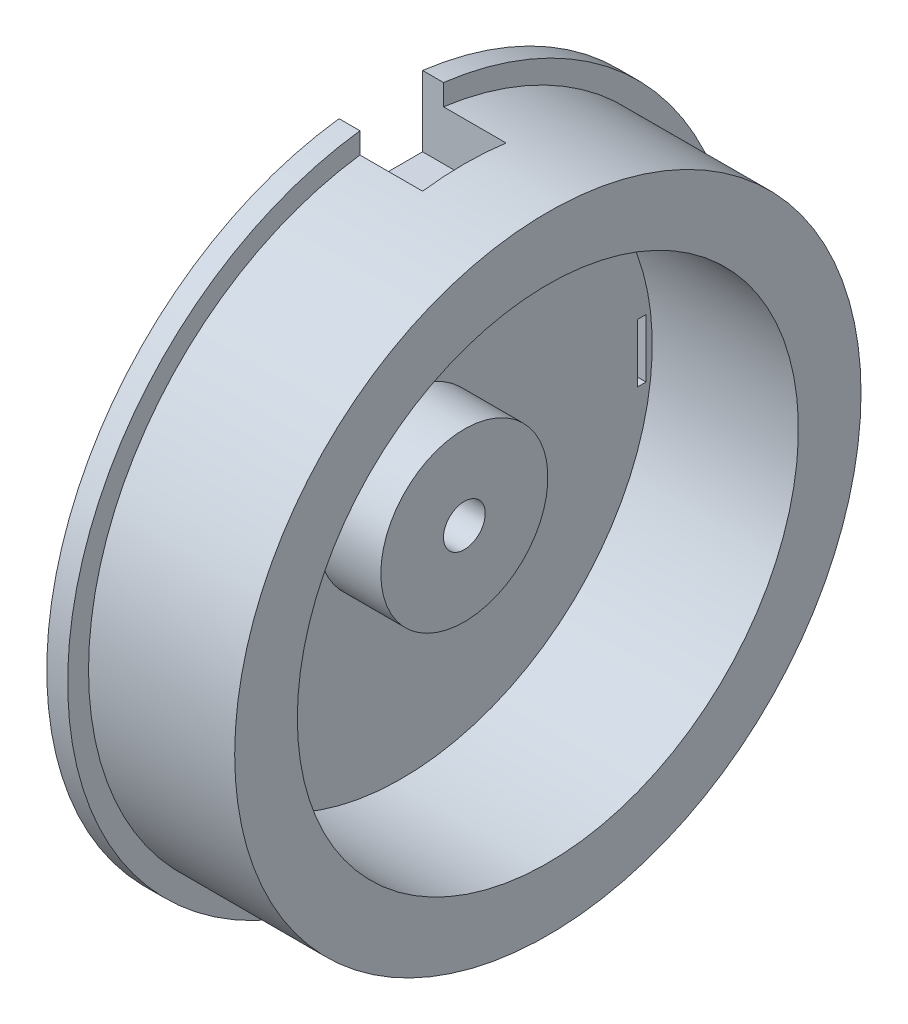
ISO-10303-21;
HEADER;
FILE_DESCRIPTION(('STEP AP214'),'2;1');
FILE_NAME('part.step','',(''),(''),'','','');
FILE_SCHEMA(('AUTOMOTIVE_DESIGN { 1 0 10303 214 1 1 1 1 }'));
ENDSEC;
DATA;
#1=APPLICATION_CONTEXT('core data for automotive mechanical design processes');
#2=APPLICATION_PROTOCOL_DEFINITION('international standard','automotive_design',2000,#1);
#3=PRODUCT_CONTEXT('',#1,'mechanical');
#4=PRODUCT('Part','Part','',(#3));
#5=PRODUCT_RELATED_PRODUCT_CATEGORY('part','',(#4));
#6=PRODUCT_DEFINITION_FORMATION('','',#4);
#7=PRODUCT_DEFINITION_CONTEXT('part definition',#1,'design');
#8=PRODUCT_DEFINITION('design','',#6,#7);
#9=PRODUCT_DEFINITION_SHAPE('','',#8);
#10=(LENGTH_UNIT() NAMED_UNIT(*) SI_UNIT(.MILLI.,.METRE.));
#11=(NAMED_UNIT(*) PLANE_ANGLE_UNIT() SI_UNIT($,.RADIAN.));
#12=(NAMED_UNIT(*) SI_UNIT($,.STERADIAN.) SOLID_ANGLE_UNIT());
#13=UNCERTAINTY_MEASURE_WITH_UNIT(LENGTH_MEASURE(1.E-05),#10,'distance_accuracy_value','');
#14=(GEOMETRIC_REPRESENTATION_CONTEXT(3) GLOBAL_UNCERTAINTY_ASSIGNED_CONTEXT((#13)) GLOBAL_UNIT_ASSIGNED_CONTEXT((#10,
#11,#12)) REPRESENTATION_CONTEXT('',''));
#15=CARTESIAN_POINT('',(0.,0.,0.));
#16=DIRECTION('',(0.,0.,1.));
#17=DIRECTION('',(1.,0.,0.));
#18=AXIS2_PLACEMENT_3D('',#15,#16,#17);
#19=CARTESIAN_POINT('',(0.,0.,0.));
#20=DIRECTION('',(-1.,0.,0.));
#21=DIRECTION('',(0.,0.,1.));
#22=AXIS2_PLACEMENT_3D('',#19,#20,#21);
#23=CYLINDRICAL_SURFACE('',#22,15.9999999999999);
#24=CARTESIAN_POINT('',(0.,0.,0.));
#25=DIRECTION('',(-1.,0.,0.));
#26=DIRECTION('',(0.,0.,1.));
#27=AXIS2_PLACEMENT_3D('',#24,#25,#26);
#28=CIRCLE('',#27,15.9999999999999);
#29=CARTESIAN_POINT('',(0.,-15.8745078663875,1.99999999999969));
#30=VERTEX_POINT('',#29);
#31=CARTESIAN_POINT('',(0.,15.8745078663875,1.99999999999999));
#32=VERTEX_POINT('',#31);
#33=EDGE_CURVE('E307',#30,#32,#28,.T.);
#34=ORIENTED_EDGE('',*,*,#33,.F.);
#35=DIRECTION('',(-1.,0.,0.));
#36=VECTOR('',#35,1.);
#37=CARTESIAN_POINT('',(4.,-15.8745078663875,1.99999999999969));
#38=LINE('',#37,#36);
#39=CARTESIAN_POINT('',(0.999999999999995,-15.8745078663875,1.99999999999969));
#40=VERTEX_POINT('',#39);
#41=EDGE_CURVE('E251',#40,#30,#38,.T.);
#42=ORIENTED_EDGE('',*,*,#41,.F.);
#43=CARTESIAN_POINT('',(0.999999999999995,0.,0.));
#44=DIRECTION('',(-1.,0.,0.));
#45=DIRECTION('',(0.,0.,1.));
#46=AXIS2_PLACEMENT_3D('',#43,#44,#45);
#47=CIRCLE('',#46,15.9999999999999);
#48=CARTESIAN_POINT('',(0.999999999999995,15.8745078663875,1.99999999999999));
#49=VERTEX_POINT('',#48);
#50=EDGE_CURVE('E342',#40,#49,#47,.T.);
#51=ORIENTED_EDGE('',*,*,#50,.T.);
#52=DIRECTION('',(-1.,0.,0.));
#53=VECTOR('',#52,1.);
#54=CARTESIAN_POINT('',(4.,15.8745078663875,1.99999999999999));
#55=LINE('',#54,#53);
#56=EDGE_CURVE('E291',#49,#32,#55,.T.);
#57=ORIENTED_EDGE('',*,*,#56,.T.);
#58=EDGE_LOOP('',(#34,#42,#51,#57));
#59=FACE_BOUND('',#58,.T.);
#60=ADVANCED_FACE('F27',(#59),#23,.T.);
#61=CARTESIAN_POINT('',(0.999999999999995,15.9999999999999,0.));
#62=DIRECTION('',(-1.,0.,0.));
#63=DIRECTION('',(0.,0.,1.));
#64=AXIS2_PLACEMENT_3D('',#61,#62,#63);
#65=PLANE('',#64);
#66=ORIENTED_EDGE('',*,*,#50,.F.);
#67=DIRECTION('',(0.,1.,0.));
#68=VECTOR('',#67,1.);
#69=CARTESIAN_POINT('',(0.999999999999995,15.9999999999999,2.00000000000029));
#70=LINE('',#69,#68);
#71=CARTESIAN_POINT('',(0.999999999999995,-14.8660687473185,1.99999999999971));
#72=VERTEX_POINT('',#71);
#73=EDGE_CURVE('E266',#40,#72,#70,.T.);
#74=ORIENTED_EDGE('',*,*,#73,.T.);
#75=CARTESIAN_POINT('',(0.999999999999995,0.,0.));
#76=DIRECTION('',(-1.,0.,0.));
#77=DIRECTION('',(0.,0.,1.));
#78=AXIS2_PLACEMENT_3D('',#75,#76,#77);
#79=CIRCLE('',#78,14.9999999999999);
#80=CARTESIAN_POINT('',(0.999999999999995,14.8660687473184,1.99999999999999));
#81=VERTEX_POINT('',#80);
#82=EDGE_CURVE('E338',#72,#81,#79,.T.);
#83=ORIENTED_EDGE('',*,*,#82,.T.);
#84=DIRECTION('',(0.,1.,0.));
#85=VECTOR('',#84,1.);
#86=CARTESIAN_POINT('',(0.999999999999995,15.9999999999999,1.99999999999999));
#87=LINE('',#86,#85);
#88=EDGE_CURVE('E298',#81,#49,#87,.T.);
#89=ORIENTED_EDGE('',*,*,#88,.T.);
#90=EDGE_LOOP('',(#66,#74,#83,#89));
#91=FACE_BOUND('',#90,.T.);
#92=ADVANCED_FACE('F380',(#91),#65,.F.);
#93=CARTESIAN_POINT('',(0.999999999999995,15.8745078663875,-1.99999999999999));
#94=VERTEX_POINT('',#93);
#95=CARTESIAN_POINT('',(0.999999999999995,-15.8745078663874,-2.00000000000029));
#96=VERTEX_POINT('',#95);
#97=EDGE_CURVE('E343',#94,#96,#47,.T.);
#98=ORIENTED_EDGE('',*,*,#97,.T.);
#99=DIRECTION('',(-1.,0.,0.));
#100=VECTOR('',#99,1.);
#101=CARTESIAN_POINT('',(4.,-15.8745078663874,-2.00000000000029));
#102=LINE('',#101,#100);
#103=CARTESIAN_POINT('',(0.,-15.8745078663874,-2.00000000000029));
#104=VERTEX_POINT('',#103);
#105=EDGE_CURVE('E253',#96,#104,#102,.T.);
#106=ORIENTED_EDGE('',*,*,#105,.T.);
#107=CARTESIAN_POINT('',(0.,15.8745078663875,-1.99999999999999));
#108=VERTEX_POINT('',#107);
#109=EDGE_CURVE('E308',#108,#104,#28,.T.);
#110=ORIENTED_EDGE('',*,*,#109,.F.);
#111=DIRECTION('',(-1.,0.,0.));
#112=VECTOR('',#111,1.);
#113=CARTESIAN_POINT('',(4.,15.8745078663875,-1.99999999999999));
#114=LINE('',#113,#112);
#115=EDGE_CURVE('E289',#94,#108,#114,.T.);
#116=ORIENTED_EDGE('',*,*,#115,.F.);
#117=EDGE_LOOP('',(#98,#106,#110,#116));
#118=FACE_BOUND('',#117,.T.);
#119=ADVANCED_FACE('F29',(#118),#23,.T.);
#120=CARTESIAN_POINT('',(0.999999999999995,14.8660687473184,-1.99999999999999));
#121=VERTEX_POINT('',#120);
#122=CARTESIAN_POINT('',(0.999999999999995,-14.8660687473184,-2.00000000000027));
#123=VERTEX_POINT('',#122);
#124=EDGE_CURVE('E339',#121,#123,#79,.T.);
#125=ORIENTED_EDGE('',*,*,#124,.T.);
#126=DIRECTION('',(0.,-1.,0.));
#127=VECTOR('',#126,1.);
#128=CARTESIAN_POINT('',(0.999999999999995,16.,-1.99999999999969));
#129=LINE('',#128,#127);
#130=EDGE_CURVE('E260',#123,#96,#129,.T.);
#131=ORIENTED_EDGE('',*,*,#130,.T.);
#132=ORIENTED_EDGE('',*,*,#97,.F.);
#133=DIRECTION('',(0.,-1.,0.));
#134=VECTOR('',#133,1.);
#135=CARTESIAN_POINT('',(0.999999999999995,15.9999999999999,-1.99999999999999));
#136=LINE('',#135,#134);
#137=EDGE_CURVE('E304',#94,#121,#136,.T.);
#138=ORIENTED_EDGE('',*,*,#137,.T.);
#139=EDGE_LOOP('',(#125,#131,#132,#138));
#140=FACE_BOUND('',#139,.T.);
#141=ADVANCED_FACE('F361',(#140),#65,.F.);
#142=CARTESIAN_POINT('',(0.,0.,0.));
#143=DIRECTION('',(-1.,0.,0.));
#144=DIRECTION('',(0.,0.,1.));
#145=AXIS2_PLACEMENT_3D('',#142,#143,#144);
#146=CYLINDRICAL_SURFACE('',#145,14.9999999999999);
#147=ORIENTED_EDGE('',*,*,#82,.F.);
#148=DIRECTION('',(-1.,0.,0.));
#149=VECTOR('',#148,1.);
#150=CARTESIAN_POINT('',(0.,-14.8660687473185,1.99999999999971));
#151=LINE('',#150,#149);
#152=CARTESIAN_POINT('',(4.,-14.8660687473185,1.99999999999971));
#153=VERTEX_POINT('',#152);
#154=EDGE_CURVE('E263',#72,#153,#151,.F.);
#155=ORIENTED_EDGE('',*,*,#154,.T.);
#156=CARTESIAN_POINT('',(4.,0.,0.));
#157=DIRECTION('',(-1.,0.,0.));
#158=DIRECTION('',(0.,0.,1.));
#159=AXIS2_PLACEMENT_3D('',#156,#157,#158);
#160=CIRCLE('',#159,14.9999999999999);
#161=CARTESIAN_POINT('',(4.,-14.8660687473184,-2.00000000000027));
#162=VERTEX_POINT('',#161);
#163=EDGE_CURVE('E11',#162,#153,#160,.T.);
#164=ORIENTED_EDGE('',*,*,#163,.F.);
#165=DIRECTION('',(-1.,0.,0.));
#166=VECTOR('',#165,1.);
#167=CARTESIAN_POINT('',(0.,-14.8660687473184,-2.00000000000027));
#168=LINE('',#167,#166);
#169=EDGE_CURVE('E250',#162,#123,#168,.T.);
#170=ORIENTED_EDGE('',*,*,#169,.T.);
#171=ORIENTED_EDGE('',*,*,#124,.F.);
#172=DIRECTION('',(-1.,0.,0.));
#173=VECTOR('',#172,1.);
#174=CARTESIAN_POINT('',(0.,14.8660687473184,-1.99999999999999));
#175=LINE('',#174,#173);
#176=CARTESIAN_POINT('',(4.,14.8660687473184,-1.99999999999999));
#177=VERTEX_POINT('',#176);
#178=EDGE_CURVE('E301',#121,#177,#175,.F.);
#179=ORIENTED_EDGE('',*,*,#178,.T.);
#180=CARTESIAN_POINT('',(4.,0.,0.));
#181=DIRECTION('',(-1.,0.,0.));
#182=DIRECTION('',(0.,0.,1.));
#183=AXIS2_PLACEMENT_3D('',#180,#181,#182);
#184=CIRCLE('',#183,14.9999999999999);
#185=CARTESIAN_POINT('',(4.,14.8660687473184,1.99999999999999));
#186=VERTEX_POINT('',#185);
#187=EDGE_CURVE('E35',#186,#177,#184,.T.);
#188=ORIENTED_EDGE('',*,*,#187,.F.);
#189=DIRECTION('',(-1.,0.,0.));
#190=VECTOR('',#189,1.);
#191=CARTESIAN_POINT('',(0.,14.8660687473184,1.99999999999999));
#192=LINE('',#191,#190);
#193=EDGE_CURVE('E288',#186,#81,#192,.T.);
#194=ORIENTED_EDGE('',*,*,#193,.T.);
#195=EDGE_LOOP('',(#147,#155,#164,#170,#171,#179,#188,#194));
#196=FACE_BOUND('',#195,.T.);
#197=CARTESIAN_POINT('',(7.99999999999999,0.,0.));
#198=DIRECTION('',(-1.,0.,0.));
#199=DIRECTION('',(0.,0.,1.));
#200=AXIS2_PLACEMENT_3D('',#197,#198,#199);
#201=CIRCLE('',#200,14.9999999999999);
#202=CARTESIAN_POINT('',(7.99999999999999,0.,14.9999999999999));
#203=VERTEX_POINT('',#202);
#204=EDGE_CURVE('E335',#203,#203,#201,.T.);
#205=ORIENTED_EDGE('',*,*,#204,.T.);
#206=EDGE_LOOP('',(#205));
#207=FACE_BOUND('',#206,.T.);
#208=ADVANCED_FACE('F357',(#196,#207),#146,.T.);
#209=CARTESIAN_POINT('',(7.99999999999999,14.9999999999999,0.));
#210=DIRECTION('',(-1.,0.,0.));
#211=DIRECTION('',(0.,0.,1.));
#212=AXIS2_PLACEMENT_3D('',#209,#210,#211);
#213=PLANE('',#212);
#214=ORIENTED_EDGE('',*,*,#204,.F.);
#215=EDGE_LOOP('',(#214));
#216=FACE_BOUND('',#215,.T.);
#217=CARTESIAN_POINT('',(7.99999999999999,0.,0.));
#218=DIRECTION('',(-1.,0.,0.));
#219=DIRECTION('',(0.,0.,1.));
#220=AXIS2_PLACEMENT_3D('',#217,#218,#219);
#221=CIRCLE('',#220,11.9999999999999);
#222=CARTESIAN_POINT('',(7.99999999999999,0.,11.9999999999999));
#223=VERTEX_POINT('',#222);
#224=EDGE_CURVE('E332',#223,#223,#221,.T.);
#225=ORIENTED_EDGE('',*,*,#224,.T.);
#226=EDGE_LOOP('',(#225));
#227=FACE_BOUND('',#226,.T.);
#228=ADVANCED_FACE('F417',(#216,#227),#213,.F.);
#229=CARTESIAN_POINT('',(0.,0.,0.));
#230=DIRECTION('',(-1.,0.,0.));
#231=DIRECTION('',(0.,0.,1.));
#232=AXIS2_PLACEMENT_3D('',#229,#230,#231);
#233=CYLINDRICAL_SURFACE('',#232,11.9999999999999);
#234=ORIENTED_EDGE('',*,*,#224,.F.);
#235=EDGE_LOOP('',(#234));
#236=FACE_BOUND('',#235,.T.);
#237=CARTESIAN_POINT('',(0.999999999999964,0.,0.));
#238=DIRECTION('',(-1.,0.,0.));
#239=DIRECTION('',(0.,0.,1.));
#240=AXIS2_PLACEMENT_3D('',#237,#238,#239);
#241=CIRCLE('',#240,11.9999999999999);
#242=CARTESIAN_POINT('',(0.999999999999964,0.,11.9999999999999));
#243=VERTEX_POINT('',#242);
#244=EDGE_CURVE('E329',#243,#243,#241,.T.);
#245=ORIENTED_EDGE('',*,*,#244,.T.);
#246=EDGE_LOOP('',(#245));
#247=FACE_BOUND('',#246,.T.);
#248=ADVANCED_FACE('F422',(#236,#247),#233,.F.);
#249=CARTESIAN_POINT('',(0.999999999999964,11.9999999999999,0.));
#250=DIRECTION('',(-1.,0.,0.));
#251=DIRECTION('',(0.,0.,1.));
#252=AXIS2_PLACEMENT_3D('',#249,#250,#251);
#253=PLANE('',#252);
#254=DIRECTION('',(0.,0.,1.));
#255=VECTOR('',#254,1.);
#256=CARTESIAN_POINT('',(0.999999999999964,-1.4,-2.54243230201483E-13));
#257=LINE('',#256,#255);
#258=CARTESIAN_POINT('',(0.999999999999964,-1.39999999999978,-11.7));
#259=VERTEX_POINT('',#258);
#260=CARTESIAN_POINT('',(0.999999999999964,-1.39999999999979,-11.3));
#261=VERTEX_POINT('',#260);
#262=EDGE_CURVE('E194',#259,#261,#257,.T.);
#263=ORIENTED_EDGE('',*,*,#262,.T.);
#264=DIRECTION('',(0.,1.,0.));
#265=VECTOR('',#264,1.);
#266=CARTESIAN_POINT('',(0.999999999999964,12.0000000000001,-11.2999999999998));
#267=LINE('',#266,#265);
#268=CARTESIAN_POINT('',(0.999999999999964,1.40000000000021,-11.3));
#269=VERTEX_POINT('',#268);
#270=EDGE_CURVE('E197',#261,#269,#267,.T.);
#271=ORIENTED_EDGE('',*,*,#270,.T.);
#272=DIRECTION('',(0.,0.,-1.));
#273=VECTOR('',#272,1.);
#274=CARTESIAN_POINT('',(0.999999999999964,1.4,-2.06864050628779E-13));
#275=LINE('',#274,#273);
#276=CARTESIAN_POINT('',(0.999999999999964,1.40000000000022,-11.7));
#277=VERTEX_POINT('',#276);
#278=EDGE_CURVE('E189',#269,#277,#275,.T.);
#279=ORIENTED_EDGE('',*,*,#278,.T.);
#280=DIRECTION('',(0.,-1.,0.));
#281=VECTOR('',#280,1.);
#282=CARTESIAN_POINT('',(0.999999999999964,12.0000000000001,-11.6999999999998));
#283=LINE('',#282,#281);
#284=EDGE_CURVE('E169',#277,#259,#283,.T.);
#285=ORIENTED_EDGE('',*,*,#284,.T.);
#286=EDGE_LOOP('',(#263,#271,#279,#285));
#287=FACE_BOUND('',#286,.T.);
#288=DIRECTION('',(0.,0.,-1.));
#289=VECTOR('',#288,1.);
#290=CARTESIAN_POINT('',(0.999999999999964,1.4,0.));
#291=LINE('',#290,#289);
#292=CARTESIAN_POINT('',(0.999999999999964,1.4,11.7));
#293=VERTEX_POINT('',#292);
#294=CARTESIAN_POINT('',(0.999999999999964,1.4,11.3));
#295=VERTEX_POINT('',#294);
#296=EDGE_CURVE('E226',#293,#295,#291,.T.);
#297=ORIENTED_EDGE('',*,*,#296,.T.);
#298=DIRECTION('',(0.,-1.,0.));
#299=VECTOR('',#298,1.);
#300=CARTESIAN_POINT('',(0.999999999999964,11.9999999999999,11.3));
#301=LINE('',#300,#299);
#302=CARTESIAN_POINT('',(0.999999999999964,-1.4,11.3));
#303=VERTEX_POINT('',#302);
#304=EDGE_CURVE('E229',#295,#303,#301,.T.);
#305=ORIENTED_EDGE('',*,*,#304,.T.);
#306=DIRECTION('',(0.,0.,1.));
#307=VECTOR('',#306,1.);
#308=CARTESIAN_POINT('',(0.999999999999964,-1.39999999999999,0.));
#309=LINE('',#308,#307);
#310=CARTESIAN_POINT('',(0.999999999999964,-1.4,11.7));
#311=VERTEX_POINT('',#310);
#312=EDGE_CURVE('E214',#303,#311,#309,.T.);
#313=ORIENTED_EDGE('',*,*,#312,.T.);
#314=DIRECTION('',(0.,1.,0.));
#315=VECTOR('',#314,1.);
#316=CARTESIAN_POINT('',(0.999999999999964,11.9999999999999,11.7));
#317=LINE('',#316,#315);
#318=EDGE_CURVE('E223',#311,#293,#317,.T.);
#319=ORIENTED_EDGE('',*,*,#318,.T.);
#320=EDGE_LOOP('',(#297,#305,#313,#319));
#321=FACE_BOUND('',#320,.T.);
#322=ORIENTED_EDGE('',*,*,#244,.F.);
#323=EDGE_LOOP('',(#322));
#324=FACE_BOUND('',#323,.T.);
#325=CARTESIAN_POINT('',(0.999999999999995,0.,0.));
#326=DIRECTION('',(-1.,0.,0.));
#327=DIRECTION('',(0.,0.,1.));
#328=AXIS2_PLACEMENT_3D('',#325,#326,#327);
#329=CIRCLE('',#328,3.99999999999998);
#330=CARTESIAN_POINT('',(0.999999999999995,0.,3.99999999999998));
#331=VERTEX_POINT('',#330);
#332=EDGE_CURVE('E326',#331,#331,#329,.T.);
#333=ORIENTED_EDGE('',*,*,#332,.T.);
#334=EDGE_LOOP('',(#333));
#335=FACE_BOUND('',#334,.T.);
#336=ADVANCED_FACE('F426',(#287,#321,#324,#335),#253,.F.);
#337=CARTESIAN_POINT('',(0.,0.,0.));
#338=DIRECTION('',(-1.,0.,0.));
#339=DIRECTION('',(0.,0.,1.));
#340=AXIS2_PLACEMENT_3D('',#337,#338,#339);
#341=CYLINDRICAL_SURFACE('',#340,3.99999999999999);
#342=ORIENTED_EDGE('',*,*,#332,.F.);
#343=EDGE_LOOP('',(#342));
#344=FACE_BOUND('',#343,.T.);
#345=CARTESIAN_POINT('',(3.99999999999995,0.,0.));
#346=DIRECTION('',(-1.,0.,0.));
#347=DIRECTION('',(0.,0.,1.));
#348=AXIS2_PLACEMENT_3D('',#345,#346,#347);
#349=CIRCLE('',#348,3.99999999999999);
#350=CARTESIAN_POINT('',(3.99999999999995,0.,3.99999999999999));
#351=VERTEX_POINT('',#350);
#352=EDGE_CURVE('E323',#351,#351,#349,.T.);
#353=ORIENTED_EDGE('',*,*,#352,.T.);
#354=EDGE_LOOP('',(#353));
#355=FACE_BOUND('',#354,.T.);
#356=ADVANCED_FACE('F430',(#344,#355),#341,.T.);
#357=CARTESIAN_POINT('',(3.99999999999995,3.99999999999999,0.));
#358=DIRECTION('',(-1.,0.,0.));
#359=DIRECTION('',(0.,0.,1.));
#360=AXIS2_PLACEMENT_3D('',#357,#358,#359);
#361=PLANE('',#360);
#362=ORIENTED_EDGE('',*,*,#352,.F.);
#363=EDGE_LOOP('',(#362));
#364=FACE_BOUND('',#363,.T.);
#365=CARTESIAN_POINT('',(3.99999999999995,0.,0.));
#366=DIRECTION('',(-1.,0.,0.));
#367=DIRECTION('',(0.,0.,1.));
#368=AXIS2_PLACEMENT_3D('',#365,#366,#367);
#369=CIRCLE('',#368,0.99999999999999);
#370=CARTESIAN_POINT('',(3.99999999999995,0.,0.99999999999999));
#371=VERTEX_POINT('',#370);
#372=EDGE_CURVE('E320',#371,#371,#369,.T.);
#373=ORIENTED_EDGE('',*,*,#372,.T.);
#374=EDGE_LOOP('',(#373));
#375=FACE_BOUND('',#374,.T.);
#376=ADVANCED_FACE('F434',(#364,#375),#361,.F.);
#377=CARTESIAN_POINT('',(0.,0.,0.));
#378=DIRECTION('',(-1.,0.,0.));
#379=DIRECTION('',(0.,0.,1.));
#380=AXIS2_PLACEMENT_3D('',#377,#378,#379);
#381=CYLINDRICAL_SURFACE('',#380,0.999999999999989);
#382=ORIENTED_EDGE('',*,*,#372,.F.);
#383=EDGE_LOOP('',(#382));
#384=FACE_BOUND('',#383,.T.);
#385=CARTESIAN_POINT('',(-0.999999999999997,0.,0.));
#386=DIRECTION('',(-1.,0.,0.));
#387=DIRECTION('',(0.,0.,1.));
#388=AXIS2_PLACEMENT_3D('',#385,#386,#387);
#389=CIRCLE('',#388,0.999999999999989);
#390=CARTESIAN_POINT('',(-0.999999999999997,0.,0.999999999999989));
#391=VERTEX_POINT('',#390);
#392=EDGE_CURVE('E317',#391,#391,#389,.T.);
#393=ORIENTED_EDGE('',*,*,#392,.T.);
#394=EDGE_LOOP('',(#393));
#395=FACE_BOUND('',#394,.T.);
#396=ADVANCED_FACE('F438',(#384,#395),#381,.F.);
#397=CARTESIAN_POINT('',(-0.999999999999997,0.999999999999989,0.));
#398=DIRECTION('',(1.,0.,0.));
#399=DIRECTION('',(0.,0.,-1.));
#400=AXIS2_PLACEMENT_3D('',#397,#398,#399);
#401=PLANE('',#400);
#402=ORIENTED_EDGE('',*,*,#392,.F.);
#403=EDGE_LOOP('',(#402));
#404=FACE_BOUND('',#403,.T.);
#405=CARTESIAN_POINT('',(-0.999999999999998,0.,0.));
#406=DIRECTION('',(-1.,0.,0.));
#407=DIRECTION('',(0.,0.,1.));
#408=AXIS2_PLACEMENT_3D('',#405,#406,#407);
#409=CIRCLE('',#408,3.99999999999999);
#410=CARTESIAN_POINT('',(-0.999999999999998,0.,3.99999999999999));
#411=VERTEX_POINT('',#410);
#412=EDGE_CURVE('E314',#411,#411,#409,.T.);
#413=ORIENTED_EDGE('',*,*,#412,.T.);
#414=EDGE_LOOP('',(#413));
#415=FACE_BOUND('',#414,.T.);
#416=ADVANCED_FACE('F442',(#404,#415),#401,.F.);
#417=CARTESIAN_POINT('',(0.,0.,0.));
#418=DIRECTION('',(-1.,0.,0.));
#419=DIRECTION('',(0.,0.,1.));
#420=AXIS2_PLACEMENT_3D('',#417,#418,#419);
#421=CYLINDRICAL_SURFACE('',#420,3.99999999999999);
#422=ORIENTED_EDGE('',*,*,#412,.F.);
#423=EDGE_LOOP('',(#422));
#424=FACE_BOUND('',#423,.T.);
#425=CARTESIAN_POINT('',(0.,0.,0.));
#426=DIRECTION('',(-1.,0.,0.));
#427=DIRECTION('',(0.,0.,1.));
#428=AXIS2_PLACEMENT_3D('',#425,#426,#427);
#429=CIRCLE('',#428,4.);
#430=CARTESIAN_POINT('',(0.,0.,4.));
#431=VERTEX_POINT('',#430);
#432=EDGE_CURVE('E311',#431,#431,#429,.T.);
#433=ORIENTED_EDGE('',*,*,#432,.T.);
#434=EDGE_LOOP('',(#433));
#435=FACE_BOUND('',#434,.T.);
#436=ADVANCED_FACE('F446',(#424,#435),#421,.T.);
#437=CARTESIAN_POINT('',(0.,4.,0.));
#438=DIRECTION('',(1.,0.,0.));
#439=DIRECTION('',(0.,0.,-1.));
#440=AXIS2_PLACEMENT_3D('',#437,#438,#439);
#441=PLANE('',#440);
#442=DIRECTION('',(0.,0.,-1.));
#443=VECTOR('',#442,1.);
#444=CARTESIAN_POINT('',(0.,1.40000000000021,-11.3));
#445=LINE('',#444,#443);
#446=CARTESIAN_POINT('',(0.,1.40000000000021,-11.3));
#447=VERTEX_POINT('',#446);
#448=CARTESIAN_POINT('',(0.,1.40000000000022,-11.7));
#449=VERTEX_POINT('',#448);
#450=EDGE_CURVE('E175',#447,#449,#445,.T.);
#451=ORIENTED_EDGE('',*,*,#450,.F.);
#452=DIRECTION('',(0.,1.,0.));
#453=VECTOR('',#452,1.);
#454=CARTESIAN_POINT('',(0.,-1.39999999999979,-11.3));
#455=LINE('',#454,#453);
#456=CARTESIAN_POINT('',(0.,-1.39999999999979,-11.3));
#457=VERTEX_POINT('',#456);
#458=EDGE_CURVE('E50',#457,#447,#455,.T.);
#459=ORIENTED_EDGE('',*,*,#458,.F.);
#460=DIRECTION('',(0.,0.,1.));
#461=VECTOR('',#460,1.);
#462=CARTESIAN_POINT('',(0.,-1.39999999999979,-11.3));
#463=LINE('',#462,#461);
#464=CARTESIAN_POINT('',(0.,-1.39999999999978,-11.7));
#465=VERTEX_POINT('',#464);
#466=EDGE_CURVE('E182',#465,#457,#463,.T.);
#467=ORIENTED_EDGE('',*,*,#466,.F.);
#468=DIRECTION('',(0.,-1.,0.));
#469=VECTOR('',#468,1.);
#470=CARTESIAN_POINT('',(0.,-1.39999999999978,-11.7));
#471=LINE('',#470,#469);
#472=EDGE_CURVE('E166',#449,#465,#471,.T.);
#473=ORIENTED_EDGE('',*,*,#472,.F.);
#474=EDGE_LOOP('',(#451,#459,#467,#473));
#475=FACE_BOUND('',#474,.T.);
#476=DIRECTION('',(0.,0.,1.));
#477=VECTOR('',#476,1.);
#478=CARTESIAN_POINT('',(0.,-1.4,11.3));
#479=LINE('',#478,#477);
#480=CARTESIAN_POINT('',(0.,-1.4,11.3));
#481=VERTEX_POINT('',#480);
#482=CARTESIAN_POINT('',(0.,-1.4,11.7));
#483=VERTEX_POINT('',#482);
#484=EDGE_CURVE('E202',#481,#483,#479,.T.);
#485=ORIENTED_EDGE('',*,*,#484,.F.);
#486=DIRECTION('',(0.,-1.,0.));
#487=VECTOR('',#486,1.);
#488=CARTESIAN_POINT('',(0.,1.4,11.3));
#489=LINE('',#488,#487);
#490=CARTESIAN_POINT('',(0.,1.4,11.3));
#491=VERTEX_POINT('',#490);
#492=EDGE_CURVE('E200',#491,#481,#489,.T.);
#493=ORIENTED_EDGE('',*,*,#492,.F.);
#494=DIRECTION('',(0.,0.,-1.));
#495=VECTOR('',#494,1.);
#496=CARTESIAN_POINT('',(0.,1.4,11.3));
#497=LINE('',#496,#495);
#498=CARTESIAN_POINT('',(0.,1.4,11.7));
#499=VERTEX_POINT('',#498);
#500=EDGE_CURVE('E208',#499,#491,#497,.T.);
#501=ORIENTED_EDGE('',*,*,#500,.F.);
#502=DIRECTION('',(0.,1.,0.));
#503=VECTOR('',#502,1.);
#504=CARTESIAN_POINT('',(0.,1.4,11.7));
#505=LINE('',#504,#503);
#506=EDGE_CURVE('E205',#483,#499,#505,.T.);
#507=ORIENTED_EDGE('',*,*,#506,.F.);
#508=EDGE_LOOP('',(#485,#493,#501,#507));
#509=FACE_BOUND('',#508,.T.);
#510=ORIENTED_EDGE('',*,*,#432,.F.);
#511=EDGE_LOOP('',(#510));
#512=FACE_BOUND('',#511,.T.);
#513=DIRECTION('',(0.,0.,-1.));
#514=VECTOR('',#513,1.);
#515=CARTESIAN_POINT('',(0.,-12.5,1.99999999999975));
#516=LINE('',#515,#514);
#517=CARTESIAN_POINT('',(0.,-12.5,1.99999999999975));
#518=VERTEX_POINT('',#517);
#519=CARTESIAN_POINT('',(0.,-12.5,-2.00000000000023));
#520=VERTEX_POINT('',#519);
#521=EDGE_CURVE('E232',#518,#520,#516,.T.);
#522=ORIENTED_EDGE('',*,*,#521,.F.);
#523=DIRECTION('',(0.,1.,0.));
#524=VECTOR('',#523,1.);
#525=CARTESIAN_POINT('',(0.,-15.8745078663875,1.99999999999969));
#526=LINE('',#525,#524);
#527=EDGE_CURVE('E236',#30,#518,#526,.T.);
#528=ORIENTED_EDGE('',*,*,#527,.F.);
#529=ORIENTED_EDGE('',*,*,#33,.T.);
#530=DIRECTION('',(0.,1.,0.));
#531=VECTOR('',#530,1.);
#532=CARTESIAN_POINT('',(0.,12.5,1.99999999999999));
#533=LINE('',#532,#531);
#534=CARTESIAN_POINT('',(0.,12.5,1.99999999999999));
#535=VERTEX_POINT('',#534);
#536=EDGE_CURVE('E271',#535,#32,#533,.T.);
#537=ORIENTED_EDGE('',*,*,#536,.F.);
#538=DIRECTION('',(0.,0.,1.));
#539=VECTOR('',#538,1.);
#540=CARTESIAN_POINT('',(0.,12.5,-1.99999999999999));
#541=LINE('',#540,#539);
#542=CARTESIAN_POINT('',(0.,12.5,-1.99999999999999));
#543=VERTEX_POINT('',#542);
#544=EDGE_CURVE('E269',#543,#535,#541,.T.);
#545=ORIENTED_EDGE('',*,*,#544,.F.);
#546=DIRECTION('',(0.,-1.,0.));
#547=VECTOR('',#546,1.);
#548=CARTESIAN_POINT('',(0.,15.8745078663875,-1.99999999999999));
#549=LINE('',#548,#547);
#550=EDGE_CURVE('E274',#108,#543,#549,.T.);
#551=ORIENTED_EDGE('',*,*,#550,.F.);
#552=ORIENTED_EDGE('',*,*,#109,.T.);
#553=DIRECTION('',(0.,-1.,0.));
#554=VECTOR('',#553,1.);
#555=CARTESIAN_POINT('',(0.,-12.5,-2.00000000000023));
#556=LINE('',#555,#554);
#557=EDGE_CURVE('E234',#520,#104,#556,.T.);
#558=ORIENTED_EDGE('',*,*,#557,.F.);
#559=EDGE_LOOP('',(#522,#528,#529,#537,#545,#551,#552,#558));
#560=FACE_BOUND('',#559,.T.);
#561=ADVANCED_FACE('F179',(#475,#509,#512,#560),#441,.F.);
#562=CARTESIAN_POINT('',(4.,0.,0.));
#563=DIRECTION('',(-1.,0.,0.));
#564=DIRECTION('',(0.,0.,1.));
#565=AXIS2_PLACEMENT_3D('',#562,#563,#564);
#566=PLANE('',#565);
#567=ORIENTED_EDGE('',*,*,#187,.T.);
#568=DIRECTION('',(0.,-1.,0.));
#569=VECTOR('',#568,1.);
#570=CARTESIAN_POINT('',(4.,15.8745078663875,-1.99999999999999));
#571=LINE('',#570,#569);
#572=CARTESIAN_POINT('',(4.,12.5,-1.99999999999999));
#573=VERTEX_POINT('',#572);
#574=EDGE_CURVE('E283',#177,#573,#571,.T.);
#575=ORIENTED_EDGE('',*,*,#574,.T.);
#576=DIRECTION('',(0.,0.,1.));
#577=VECTOR('',#576,1.);
#578=CARTESIAN_POINT('',(4.,12.5,-1.99999999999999));
#579=LINE('',#578,#577);
#580=CARTESIAN_POINT('',(4.,12.5,1.99999999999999));
#581=VERTEX_POINT('',#580);
#582=EDGE_CURVE('E277',#573,#581,#579,.T.);
#583=ORIENTED_EDGE('',*,*,#582,.T.);
#584=DIRECTION('',(0.,1.,0.));
#585=VECTOR('',#584,1.);
#586=CARTESIAN_POINT('',(4.,12.5,1.99999999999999));
#587=LINE('',#586,#585);
#588=EDGE_CURVE('E280',#581,#186,#587,.T.);
#589=ORIENTED_EDGE('',*,*,#588,.T.);
#590=EDGE_LOOP('',(#567,#575,#583,#589));
#591=FACE_BOUND('',#590,.T.);
#592=ADVANCED_FACE('F348',(#591),#566,.T.);
#593=CARTESIAN_POINT('',(4.,15.8745078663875,-1.99999999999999));
#594=DIRECTION('',(0.,0.,-1.));
#595=DIRECTION('',(0.,1.,0.));
#596=AXIS2_PLACEMENT_3D('',#593,#594,#595);
#597=PLANE('',#596);
#598=ORIENTED_EDGE('',*,*,#115,.T.);
#599=ORIENTED_EDGE('',*,*,#550,.T.);
#600=DIRECTION('',(-1.,0.,0.));
#601=VECTOR('',#600,1.);
#602=CARTESIAN_POINT('',(4.,12.5,-1.99999999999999));
#603=LINE('',#602,#601);
#604=EDGE_CURVE('E286',#573,#543,#603,.T.);
#605=ORIENTED_EDGE('',*,*,#604,.F.);
#606=ORIENTED_EDGE('',*,*,#574,.F.);
#607=ORIENTED_EDGE('',*,*,#178,.F.);
#608=ORIENTED_EDGE('',*,*,#137,.F.);
#609=EDGE_LOOP('',(#598,#599,#605,#606,#607,#608));
#610=FACE_BOUND('',#609,.T.);
#611=ADVANCED_FACE('F353',(#610),#597,.F.);
#612=CARTESIAN_POINT('',(4.,12.5,1.99999999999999));
#613=DIRECTION('',(0.,0.,1.));
#614=DIRECTION('',(1.,0.,0.));
#615=AXIS2_PLACEMENT_3D('',#612,#613,#614);
#616=PLANE('',#615);
#617=ORIENTED_EDGE('',*,*,#193,.F.);
#618=ORIENTED_EDGE('',*,*,#588,.F.);
#619=DIRECTION('',(-1.,0.,0.));
#620=VECTOR('',#619,1.);
#621=CARTESIAN_POINT('',(4.,12.5,1.99999999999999));
#622=LINE('',#621,#620);
#623=EDGE_CURVE('E285',#581,#535,#622,.T.);
#624=ORIENTED_EDGE('',*,*,#623,.T.);
#625=ORIENTED_EDGE('',*,*,#536,.T.);
#626=ORIENTED_EDGE('',*,*,#56,.F.);
#627=ORIENTED_EDGE('',*,*,#88,.F.);
#628=EDGE_LOOP('',(#617,#618,#624,#625,#626,#627));
#629=FACE_BOUND('',#628,.T.);
#630=ADVANCED_FACE('F375',(#629),#616,.F.);
#631=CARTESIAN_POINT('',(4.,12.5,-1.99999999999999));
#632=DIRECTION('',(0.,-1.,0.));
#633=DIRECTION('',(0.,0.,-1.));
#634=AXIS2_PLACEMENT_3D('',#631,#632,#633);
#635=PLANE('',#634);
#636=ORIENTED_EDGE('',*,*,#544,.T.);
#637=ORIENTED_EDGE('',*,*,#623,.F.);
#638=ORIENTED_EDGE('',*,*,#582,.F.);
#639=ORIENTED_EDGE('',*,*,#604,.T.);
#640=EDGE_LOOP('',(#636,#637,#638,#639));
#641=FACE_BOUND('',#640,.T.);
#642=ADVANCED_FACE('F373',(#641),#635,.F.);
#643=CARTESIAN_POINT('',(4.,0.,0.));
#644=DIRECTION('',(-1.,0.,0.));
#645=DIRECTION('',(0.,0.,-1.));
#646=AXIS2_PLACEMENT_3D('',#643,#644,#645);
#647=PLANE('',#646);
#648=ORIENTED_EDGE('',*,*,#163,.T.);
#649=DIRECTION('',(0.,1.,0.));
#650=VECTOR('',#649,1.);
#651=CARTESIAN_POINT('',(4.,-15.8745078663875,1.99999999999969));
#652=LINE('',#651,#650);
#653=CARTESIAN_POINT('',(4.,-12.5,1.99999999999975));
#654=VERTEX_POINT('',#653);
#655=EDGE_CURVE('E245',#153,#654,#652,.T.);
#656=ORIENTED_EDGE('',*,*,#655,.T.);
#657=DIRECTION('',(0.,0.,-1.));
#658=VECTOR('',#657,1.);
#659=CARTESIAN_POINT('',(4.,-12.5,1.99999999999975));
#660=LINE('',#659,#658);
#661=CARTESIAN_POINT('',(4.,-12.5,-2.00000000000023));
#662=VERTEX_POINT('',#661);
#663=EDGE_CURVE('E239',#654,#662,#660,.T.);
#664=ORIENTED_EDGE('',*,*,#663,.T.);
#665=DIRECTION('',(0.,-1.,0.));
#666=VECTOR('',#665,1.);
#667=CARTESIAN_POINT('',(4.,-12.5,-2.00000000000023));
#668=LINE('',#667,#666);
#669=EDGE_CURVE('E242',#662,#162,#668,.T.);
#670=ORIENTED_EDGE('',*,*,#669,.T.);
#671=EDGE_LOOP('',(#648,#656,#664,#670));
#672=FACE_BOUND('',#671,.T.);
#673=ADVANCED_FACE('F394',(#672),#647,.T.);
#674=CARTESIAN_POINT('',(4.,-15.8745078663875,1.99999999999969));
#675=DIRECTION('',(0.,0.,1.));
#676=DIRECTION('',(0.,-1.,0.));
#677=AXIS2_PLACEMENT_3D('',#674,#675,#676);
#678=PLANE('',#677);
#679=ORIENTED_EDGE('',*,*,#41,.T.);
#680=ORIENTED_EDGE('',*,*,#527,.T.);
#681=DIRECTION('',(-1.,0.,0.));
#682=VECTOR('',#681,1.);
#683=CARTESIAN_POINT('',(4.,-12.5,1.99999999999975));
#684=LINE('',#683,#682);
#685=EDGE_CURVE('E248',#654,#518,#684,.T.);
#686=ORIENTED_EDGE('',*,*,#685,.F.);
#687=ORIENTED_EDGE('',*,*,#655,.F.);
#688=ORIENTED_EDGE('',*,*,#154,.F.);
#689=ORIENTED_EDGE('',*,*,#73,.F.);
#690=EDGE_LOOP('',(#679,#680,#686,#687,#688,#689));
#691=FACE_BOUND('',#690,.T.);
#692=ADVANCED_FACE('F383',(#691),#678,.F.);
#693=CARTESIAN_POINT('',(4.,-12.5,-2.00000000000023));
#694=DIRECTION('',(0.,0.,-1.));
#695=DIRECTION('',(0.,1.,0.));
#696=AXIS2_PLACEMENT_3D('',#693,#694,#695);
#697=PLANE('',#696);
#698=ORIENTED_EDGE('',*,*,#169,.F.);
#699=ORIENTED_EDGE('',*,*,#669,.F.);
#700=DIRECTION('',(-1.,0.,0.));
#701=VECTOR('',#700,1.);
#702=CARTESIAN_POINT('',(4.,-12.5,-2.00000000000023));
#703=LINE('',#702,#701);
#704=EDGE_CURVE('E247',#662,#520,#703,.T.);
#705=ORIENTED_EDGE('',*,*,#704,.T.);
#706=ORIENTED_EDGE('',*,*,#557,.T.);
#707=ORIENTED_EDGE('',*,*,#105,.F.);
#708=ORIENTED_EDGE('',*,*,#130,.F.);
#709=EDGE_LOOP('',(#698,#699,#705,#706,#707,#708));
#710=FACE_BOUND('',#709,.T.);
#711=ADVANCED_FACE('F396',(#710),#697,.F.);
#712=CARTESIAN_POINT('',(4.,-12.5,1.99999999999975));
#713=DIRECTION('',(0.,1.,0.));
#714=DIRECTION('',(0.,0.,1.));
#715=AXIS2_PLACEMENT_3D('',#712,#713,#714);
#716=PLANE('',#715);
#717=ORIENTED_EDGE('',*,*,#521,.T.);
#718=ORIENTED_EDGE('',*,*,#704,.F.);
#719=ORIENTED_EDGE('',*,*,#663,.F.);
#720=ORIENTED_EDGE('',*,*,#685,.T.);
#721=EDGE_LOOP('',(#717,#718,#719,#720));
#722=FACE_BOUND('',#721,.T.);
#723=ADVANCED_FACE('F391',(#722),#716,.F.);
#724=CARTESIAN_POINT('',(7.99999999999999,1.4,11.3));
#725=DIRECTION('',(0.,0.,-1.));
#726=DIRECTION('',(-1.,0.,0.));
#727=AXIS2_PLACEMENT_3D('',#724,#725,#726);
#728=PLANE('',#727);
#729=DIRECTION('',(-1.,0.,0.));
#730=VECTOR('',#729,1.);
#731=CARTESIAN_POINT('',(7.99999999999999,1.4,11.3));
#732=LINE('',#731,#730);
#733=EDGE_CURVE('E212',#295,#491,#732,.T.);
#734=ORIENTED_EDGE('',*,*,#733,.T.);
#735=ORIENTED_EDGE('',*,*,#492,.T.);
#736=DIRECTION('',(-1.,0.,0.));
#737=VECTOR('',#736,1.);
#738=CARTESIAN_POINT('',(7.99999999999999,-1.4,11.3));
#739=LINE('',#738,#737);
#740=EDGE_CURVE('E211',#303,#481,#739,.T.);
#741=ORIENTED_EDGE('',*,*,#740,.F.);
#742=ORIENTED_EDGE('',*,*,#304,.F.);
#743=EDGE_LOOP('',(#734,#735,#741,#742));
#744=FACE_BOUND('',#743,.T.);
#745=ADVANCED_FACE('F403',(#744),#728,.F.);
#746=CARTESIAN_POINT('',(7.99999999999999,1.4,11.3));
#747=DIRECTION('',(0.,1.,0.));
#748=DIRECTION('',(0.,0.,1.));
#749=AXIS2_PLACEMENT_3D('',#746,#747,#748);
#750=PLANE('',#749);
#751=DIRECTION('',(-1.,0.,0.));
#752=VECTOR('',#751,1.);
#753=CARTESIAN_POINT('',(7.99999999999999,1.4,11.7));
#754=LINE('',#753,#752);
#755=EDGE_CURVE('E215',#293,#499,#754,.T.);
#756=ORIENTED_EDGE('',*,*,#755,.T.);
#757=ORIENTED_EDGE('',*,*,#500,.T.);
#758=ORIENTED_EDGE('',*,*,#733,.F.);
#759=ORIENTED_EDGE('',*,*,#296,.F.);
#760=EDGE_LOOP('',(#756,#757,#758,#759));
#761=FACE_BOUND('',#760,.T.);
#762=ADVANCED_FACE('F500',(#761),#750,.F.);
#763=CARTESIAN_POINT('',(7.99999999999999,1.4,11.7));
#764=DIRECTION('',(0.,0.,1.));
#765=DIRECTION('',(1.,0.,0.));
#766=AXIS2_PLACEMENT_3D('',#763,#764,#765);
#767=PLANE('',#766);
#768=DIRECTION('',(-1.,0.,0.));
#769=VECTOR('',#768,1.);
#770=CARTESIAN_POINT('',(7.99999999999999,-1.4,11.7));
#771=LINE('',#770,#769);
#772=EDGE_CURVE('E217',#311,#483,#771,.T.);
#773=ORIENTED_EDGE('',*,*,#772,.T.);
#774=ORIENTED_EDGE('',*,*,#506,.T.);
#775=ORIENTED_EDGE('',*,*,#755,.F.);
#776=ORIENTED_EDGE('',*,*,#318,.F.);
#777=EDGE_LOOP('',(#773,#774,#775,#776));
#778=FACE_BOUND('',#777,.T.);
#779=ADVANCED_FACE('F508',(#778),#767,.F.);
#780=CARTESIAN_POINT('',(7.99999999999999,-1.4,11.3));
#781=DIRECTION('',(0.,-1.,0.));
#782=DIRECTION('',(0.,0.,-1.));
#783=AXIS2_PLACEMENT_3D('',#780,#781,#782);
#784=PLANE('',#783);
#785=ORIENTED_EDGE('',*,*,#740,.T.);
#786=ORIENTED_EDGE('',*,*,#484,.T.);
#787=ORIENTED_EDGE('',*,*,#772,.F.);
#788=ORIENTED_EDGE('',*,*,#312,.F.);
#789=EDGE_LOOP('',(#785,#786,#787,#788));
#790=FACE_BOUND('',#789,.T.);
#791=ADVANCED_FACE('F516',(#790),#784,.F.);
#792=CARTESIAN_POINT('',(7.99999999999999,-1.39999999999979,-11.3));
#793=DIRECTION('',(0.,0.,1.));
#794=DIRECTION('',(0.,-1.,0.));
#795=AXIS2_PLACEMENT_3D('',#792,#793,#794);
#796=PLANE('',#795);
#797=DIRECTION('',(-1.,0.,0.));
#798=VECTOR('',#797,1.);
#799=CARTESIAN_POINT('',(7.99999999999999,-1.39999999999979,-11.3));
#800=LINE('',#799,#798);
#801=EDGE_CURVE('E187',#261,#457,#800,.T.);
#802=ORIENTED_EDGE('',*,*,#801,.T.);
#803=ORIENTED_EDGE('',*,*,#458,.T.);
#804=DIRECTION('',(-1.,0.,0.));
#805=VECTOR('',#804,1.);
#806=CARTESIAN_POINT('',(7.99999999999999,1.40000000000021,-11.3));
#807=LINE('',#806,#805);
#808=EDGE_CURVE('E172',#269,#447,#807,.T.);
#809=ORIENTED_EDGE('',*,*,#808,.F.);
#810=ORIENTED_EDGE('',*,*,#270,.F.);
#811=EDGE_LOOP('',(#802,#803,#809,#810));
#812=FACE_BOUND('',#811,.T.);
#813=ADVANCED_FACE('F524',(#812),#796,.F.);
#814=CARTESIAN_POINT('',(7.99999999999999,-1.39999999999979,-11.3));
#815=DIRECTION('',(0.,-1.,0.));
#816=DIRECTION('',(0.,0.,-1.));
#817=AXIS2_PLACEMENT_3D('',#814,#815,#816);
#818=PLANE('',#817);
#819=DIRECTION('',(-1.,0.,0.));
#820=VECTOR('',#819,1.);
#821=CARTESIAN_POINT('',(7.99999999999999,-1.39999999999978,-11.7));
#822=LINE('',#821,#820);
#823=EDGE_CURVE('E171',#259,#465,#822,.T.);
#824=ORIENTED_EDGE('',*,*,#823,.T.);
#825=ORIENTED_EDGE('',*,*,#466,.T.);
#826=ORIENTED_EDGE('',*,*,#801,.F.);
#827=ORIENTED_EDGE('',*,*,#262,.F.);
#828=EDGE_LOOP('',(#824,#825,#826,#827));
#829=FACE_BOUND('',#828,.T.);
#830=ADVANCED_FACE('F532',(#829),#818,.F.);
#831=CARTESIAN_POINT('',(7.99999999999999,-1.39999999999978,-11.7));
#832=DIRECTION('',(0.,0.,-1.));
#833=DIRECTION('',(0.,1.,0.));
#834=AXIS2_PLACEMENT_3D('',#831,#832,#833);
#835=PLANE('',#834);
#836=DIRECTION('',(-1.,0.,0.));
#837=VECTOR('',#836,1.);
#838=CARTESIAN_POINT('',(7.99999999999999,1.40000000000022,-11.7));
#839=LINE('',#838,#837);
#840=EDGE_CURVE('E42',#277,#449,#839,.T.);
#841=ORIENTED_EDGE('',*,*,#840,.T.);
#842=ORIENTED_EDGE('',*,*,#472,.T.);
#843=ORIENTED_EDGE('',*,*,#823,.F.);
#844=ORIENTED_EDGE('',*,*,#284,.F.);
#845=EDGE_LOOP('',(#841,#842,#843,#844));
#846=FACE_BOUND('',#845,.T.);
#847=ADVANCED_FACE('F163',(#846),#835,.F.);
#848=CARTESIAN_POINT('',(7.99999999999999,1.40000000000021,-11.3));
#849=DIRECTION('',(0.,1.,0.));
#850=DIRECTION('',(0.,0.,1.));
#851=AXIS2_PLACEMENT_3D('',#848,#849,#850);
#852=PLANE('',#851);
#853=ORIENTED_EDGE('',*,*,#808,.T.);
#854=ORIENTED_EDGE('',*,*,#450,.T.);
#855=ORIENTED_EDGE('',*,*,#840,.F.);
#856=ORIENTED_EDGE('',*,*,#278,.F.);
#857=EDGE_LOOP('',(#853,#854,#855,#856));
#858=FACE_BOUND('',#857,.T.);
#859=ADVANCED_FACE('F176',(#858),#852,.F.);
#860=CLOSED_SHELL('',(#60,#92,#119,#141,#208,#228,#248,#336,#356,#376,#396,#416,#436,#561,#592,
#611,#630,#642,#673,#692,#711,#723,#745,#762,#779,#791,#813,#830,#847,#859));
#861=MANIFOLD_SOLID_BREP('B2',#860);
#862=ADVANCED_BREP_SHAPE_REPRESENTATION('',(#18,#861),#14);
#863=SHAPE_DEFINITION_REPRESENTATION(#9,#862);
ENDSEC;
END-ISO-10303-21;
